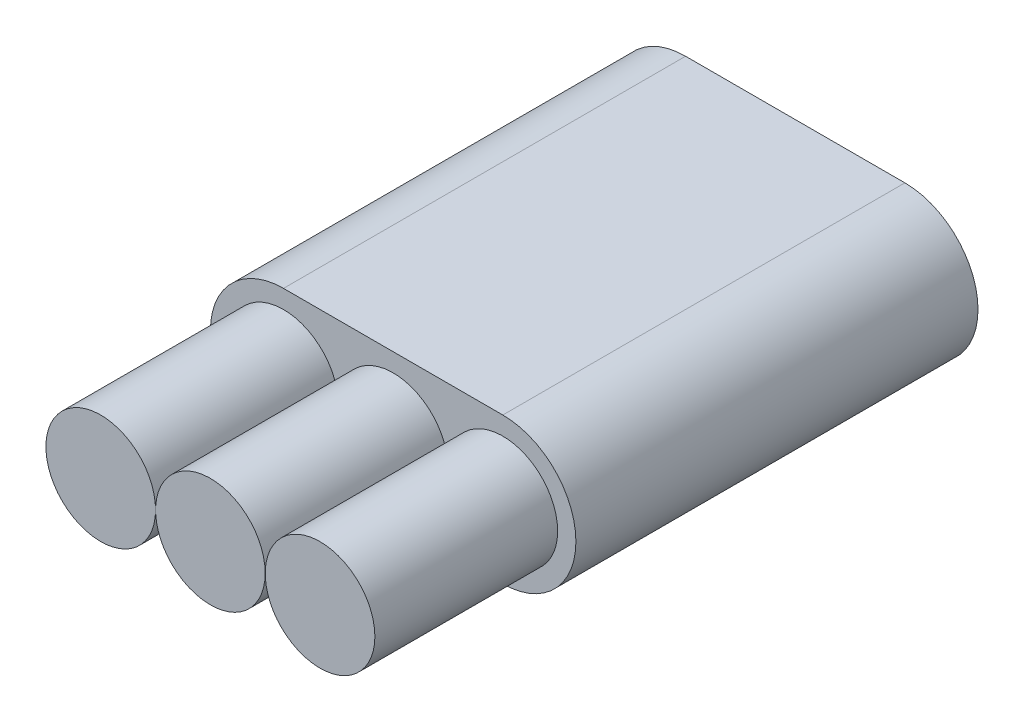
from build123d import *

# Parameters (mm, degrees)
BOSS_EXTRUDE1_DEPTH = 11
SKETCH2_R           = 1.5
SKETCH2_R_2         = 1.499
BOSS_EXTRUDE5_DEPTH = 5


with BuildPart() as part:
    # Sketch1 → Boss-Extrude1 (new body)
    with BuildSketch(Plane.XY):
        with BuildLine():
            Line((1.5, -0.5), (7.5, -0.5))
            ThreePointArc((7.5, -0.5), (9.5, 1.5), (7.5, 3.5))
            Line((7.5, 3.5), (1.5, 3.5))
            ThreePointArc((1.5, 3.5), (-0.5, 1.5), (1.5, -0.5))
        make_face()
    extrude(amount=BOSS_EXTRUDE1_DEPTH)

    # Sketch2 → Boss-Extrude5 (add)
    with BuildSketch(Plane.XY.offset(11)):
        with Locations((1.5, 1.5)):
            Circle(SKETCH2_R)
        with Locations((7.5, 1.5)):
            Circle(SKETCH2_R)
        with Locations((4.5, 1.5)):
            Circle(SKETCH2_R_2)
    extrude(amount=BOSS_EXTRUDE5_DEPTH)


solid = part.part
